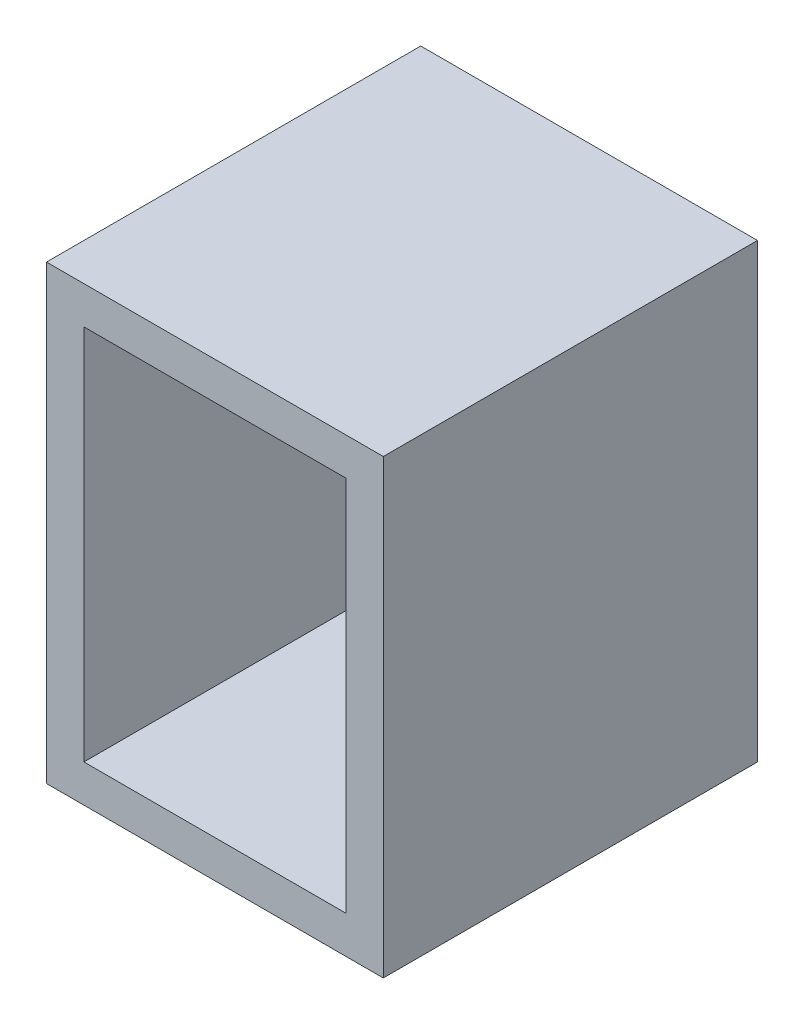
from build123d import *

# Parameters (mm, degrees)
SKETCH1_W      = 35
SKETCH1_H      = 50.346
EXTRUDE1_DEPTH = 25
SHELL1_T       = 5


with BuildPart() as part:
    # Sketch1 → Extrude1 (new, symmetric)
    with BuildSketch(Plane.XY):
        Rectangle(SKETCH1_W, SKETCH1_H)
    extrude(amount=EXTRUDE1_DEPTH, both=True)

    # Shell1
    shell1_openings = [part.faces().sort_by_distance(p)[0] for p in [
        (0, 0, 25),
        (0, 0, -25),
    ]]
    offset(amount=SHELL1_T, openings=shell1_openings, kind=Kind.INTERSECTION)


solid = part.part
